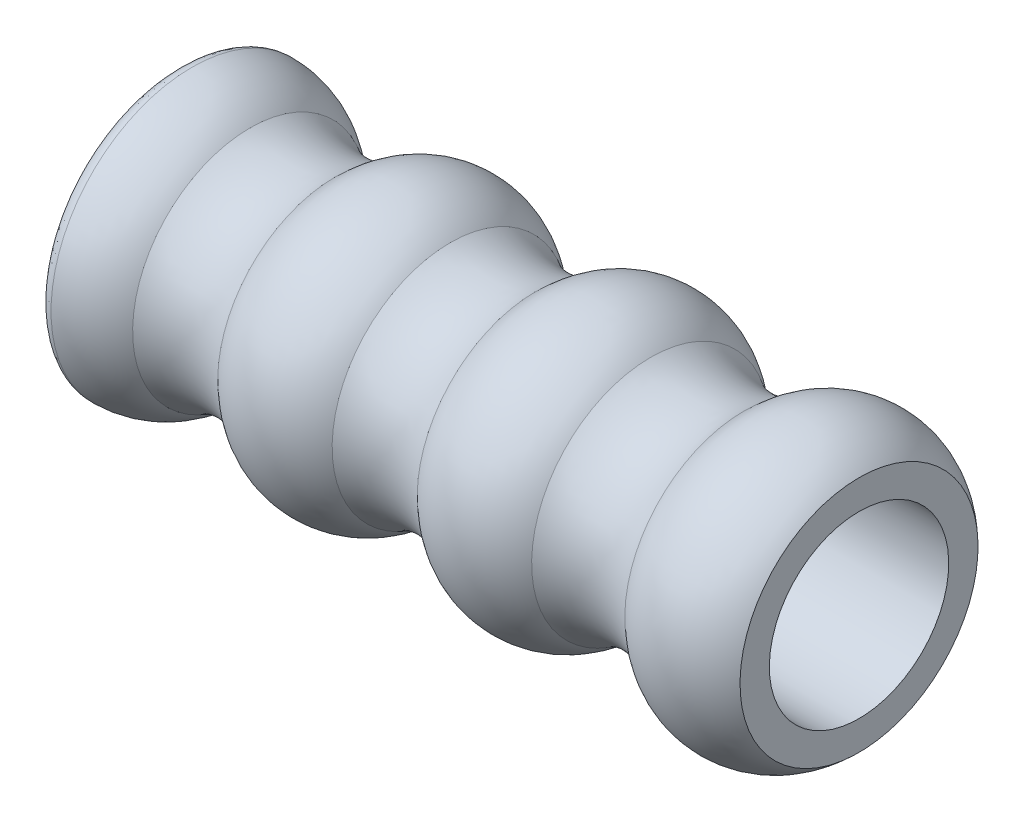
ISO-10303-21;
HEADER;
FILE_DESCRIPTION(('STEP AP214'),'2;1');
FILE_NAME('part.step','',(''),(''),'','','');
FILE_SCHEMA(('AUTOMOTIVE_DESIGN { 1 0 10303 214 1 1 1 1 }'));
ENDSEC;
DATA;
#1=APPLICATION_CONTEXT('core data for automotive mechanical design processes');
#2=APPLICATION_PROTOCOL_DEFINITION('international standard','automotive_design',2000,#1);
#3=PRODUCT_CONTEXT('',#1,'mechanical');
#4=PRODUCT('Part','Part','',(#3));
#5=PRODUCT_RELATED_PRODUCT_CATEGORY('part','',(#4));
#6=PRODUCT_DEFINITION_FORMATION('','',#4);
#7=PRODUCT_DEFINITION_CONTEXT('part definition',#1,'design');
#8=PRODUCT_DEFINITION('design','',#6,#7);
#9=PRODUCT_DEFINITION_SHAPE('','',#8);
#10=(LENGTH_UNIT() NAMED_UNIT(*) SI_UNIT(.MILLI.,.METRE.));
#11=(NAMED_UNIT(*) PLANE_ANGLE_UNIT() SI_UNIT($,.RADIAN.));
#12=(NAMED_UNIT(*) SI_UNIT($,.STERADIAN.) SOLID_ANGLE_UNIT());
#13=UNCERTAINTY_MEASURE_WITH_UNIT(LENGTH_MEASURE(1.E-05),#10,'distance_accuracy_value','');
#14=(GEOMETRIC_REPRESENTATION_CONTEXT(3) GLOBAL_UNCERTAINTY_ASSIGNED_CONTEXT((#13)) GLOBAL_UNIT_ASSIGNED_CONTEXT((#10,
#11,#12)) REPRESENTATION_CONTEXT('',''));
#15=CARTESIAN_POINT('',(0.,0.,0.));
#16=DIRECTION('',(0.,0.,1.));
#17=DIRECTION('',(1.,0.,0.));
#18=AXIS2_PLACEMENT_3D('',#15,#16,#17);
#19=CARTESIAN_POINT('',(1.88297787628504,-21.1381937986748,0.));
#20=DIRECTION('',(0.,0.,1.00000000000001));
#21=DIRECTION('',(0.,1.00000000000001,0.));
#22=AXIS2_PLACEMENT_3D('',#19,#20,#21);
#23=ELLIPSE('',#22,21.961784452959,6.03153225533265);
#24=TRIMMED_CURVE('',#23,(PARAMETER_VALUE(-1.57253642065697)),
(PARAMETER_VALUE(1.57253642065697)),.T.,.PARAMETER.);
#25=CARTESIAN_POINT('',(103.092609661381,-21.1764093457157,0.));
#26=DIRECTION('',(1.00000000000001,0.,0.));
#27=AXIS1_PLACEMENT('',#25,#26);
#28=SURFACE_OF_REVOLUTION('',#24,#27);
#29=CARTESIAN_POINT('',(-2.77282689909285,-21.1764093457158,0.));
#30=DIRECTION('',(1.00000000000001,0.,0.));
#31=DIRECTION('',(0.,1.00000000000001,0.));
#32=AXIS2_PLACEMENT_3D('',#29,#30,#31);
#33=CIRCLE('',#32,14.);
#34=CARTESIAN_POINT('',(-2.77282689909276,-7.17640934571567,0.));
#35=VERTEX_POINT('',#34);
#36=EDGE_CURVE('E383',#35,#35,#33,.F.);
#37=ORIENTED_EDGE('',*,*,#36,.F.);
#38=EDGE_LOOP('',(#37));
#39=FACE_BOUND('',#38,.T.);
#40=CARTESIAN_POINT('',(1.88297787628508,-21.1764093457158,0.));
#41=DIRECTION('',(1.00000000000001,0.,0.));
#42=DIRECTION('',(0.,1.00000000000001,0.));
#43=AXIS2_PLACEMENT_3D('',#40,#41,#42);
#44=CIRCLE('',#43,22.);
#45=CARTESIAN_POINT('',(1.88297787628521,0.8235906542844,0.));
#46=VERTEX_POINT('',#45);
#47=EDGE_CURVE('E358',#46,#46,#44,.T.);
#48=ORIENTED_EDGE('',*,*,#47,.F.);
#49=EDGE_LOOP('',(#48));
#50=FACE_BOUND('',#49,.T.);
#51=ADVANCED_FACE('F351',(#39,#50),#28,.F.);
#52=CARTESIAN_POINT('',(17.5818395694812,-21.1764093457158,0.));
#53=DIRECTION('',(1.00000000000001,0.,0.));
#54=DIRECTION('',(0.,1.00000000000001,0.));
#55=AXIS2_PLACEMENT_3D('',#52,#53,#54);
#56=TOROIDAL_SURFACE('',#55,29.5,13.);
#57=CARTESIAN_POINT('',(10.9427261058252,-21.1764093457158,0.));
#58=DIRECTION('',(1.00000000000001,0.,0.));
#59=DIRECTION('',(0.,1.00000000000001,0.));
#60=AXIS2_PLACEMENT_3D('',#57,#58,#59);
#61=CIRCLE('',#60,18.3231412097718);
#62=CARTESIAN_POINT('',(10.9427261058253,-2.85326813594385,0.));
#63=VERTEX_POINT('',#62);
#64=EDGE_CURVE('E10',#63,#63,#61,.T.);
#65=ORIENTED_EDGE('',*,*,#64,.T.);
#66=EDGE_LOOP('',(#65));
#67=FACE_BOUND('',#66,.T.);
#68=CARTESIAN_POINT('',(24.2209530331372,-21.1764093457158,0.));
#69=DIRECTION('',(1.00000000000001,0.,0.));
#70=DIRECTION('',(0.,1.00000000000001,0.));
#71=AXIS2_PLACEMENT_3D('',#68,#69,#70);
#72=CIRCLE('',#71,18.3231412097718);
#73=CARTESIAN_POINT('',(24.2209530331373,-2.85326813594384,0.));
#74=VERTEX_POINT('',#73);
#75=EDGE_CURVE('E380',#74,#74,#72,.T.);
#76=ORIENTED_EDGE('',*,*,#75,.F.);
#77=EDGE_LOOP('',(#76));
#78=FACE_BOUND('',#77,.T.);
#79=ADVANCED_FACE('F353',(#67,#78),#56,.F.);
#80=CARTESIAN_POINT('',(1.88297787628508,-21.1764093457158,0.));
#81=DIRECTION('',(1.00000000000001,0.,0.));
#82=DIRECTION('',(0.,1.00000000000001,0.));
#83=AXIS2_PLACEMENT_3D('',#80,#81,#82);
#84=DEGENERATE_TOROIDAL_SURFACE('',#83,8.99999999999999,13.,.T.);
#85=ORIENTED_EDGE('',*,*,#47,.T.);
#86=EDGE_LOOP('',(#85));
#87=FACE_BOUND('',#86,.T.);
#88=ORIENTED_EDGE('',*,*,#64,.F.);
#89=EDGE_LOOP('',(#88));
#90=FACE_BOUND('',#89,.T.);
#91=ADVANCED_FACE('F393',(#87,#90),#84,.T.);
#92=CARTESIAN_POINT('',(106.004684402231,-2.60089188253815,0.));
#93=DIRECTION('',(1.00000000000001,0.,0.));
#94=DIRECTION('',(0.,1.00000000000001,0.));
#95=AXIS2_PLACEMENT_3D('',#92,#93,#94);
#96=PLANE('',#95);
#97=CARTESIAN_POINT('',(106.004684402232,-21.1764093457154,0.));
#98=DIRECTION('',(1.00000000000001,0.,0.));
#99=DIRECTION('',(0.,1.00000000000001,0.));
#100=AXIS2_PLACEMENT_3D('',#97,#98,#99);
#101=CIRCLE('',#100,14.);
#102=CARTESIAN_POINT('',(106.004684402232,-7.17640934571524,0.));
#103=VERTEX_POINT('',#102);
#104=EDGE_CURVE('E448',#103,#103,#101,.T.);
#105=ORIENTED_EDGE('',*,*,#104,.F.);
#106=EDGE_LOOP('',(#105));
#107=FACE_BOUND('',#106,.T.);
#108=CARTESIAN_POINT('',(106.004684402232,-21.1764093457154,0.));
#109=DIRECTION('',(1.00000000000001,0.,0.));
#110=DIRECTION('',(0.,1.00000000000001,0.));
#111=AXIS2_PLACEMENT_3D('',#108,#109,#110);
#112=CIRCLE('',#111,18.5755174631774);
#113=CARTESIAN_POINT('',(106.004684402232,-2.60089188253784,0.));
#114=VERTEX_POINT('',#113);
#115=EDGE_CURVE('E362',#114,#114,#112,.T.);
#116=ORIENTED_EDGE('',*,*,#115,.T.);
#117=EDGE_LOOP('',(#116));
#118=FACE_BOUND('',#117,.T.);
#119=ADVANCED_FACE('F391',(#107,#118),#96,.T.);
#120=CARTESIAN_POINT('',(97.0107991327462,-21.1764093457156,0.));
#121=DIRECTION('',(1.00000000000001,0.,0.));
#122=DIRECTION('',(0.,1.00000000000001,0.));
#123=AXIS2_PLACEMENT_3D('',#120,#121,#122);
#124=DEGENERATE_TOROIDAL_SURFACE('',#123,9.1888232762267,13.,.T.);
#125=CARTESIAN_POINT('',(88.0169138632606,-21.1764093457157,0.));
#126=DIRECTION('',(1.00000000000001,0.,0.));
#127=DIRECTION('',(0.,1.00000000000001,0.));
#128=AXIS2_PLACEMENT_3D('',#125,#126,#127);
#129=CIRCLE('',#128,18.5755174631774);
#130=CARTESIAN_POINT('',(88.0169138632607,-2.60089188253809,0.));
#131=VERTEX_POINT('',#130);
#132=EDGE_CURVE('E366',#131,#131,#129,.T.);
#133=ORIENTED_EDGE('',*,*,#132,.T.);
#134=EDGE_LOOP('',(#133));
#135=FACE_BOUND('',#134,.T.);
#136=ORIENTED_EDGE('',*,*,#115,.F.);
#137=EDGE_LOOP('',(#136));
#138=FACE_BOUND('',#137,.T.);
#139=ADVANCED_FACE('F399',(#135,#138),#124,.T.);
#140=CARTESIAN_POINT('',(80.7458506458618,-21.1764093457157,0.));
#141=DIRECTION('',(1.00000000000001,0.,0.));
#142=DIRECTION('',(0.,1.00000000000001,0.));
#143=AXIS2_PLACEMENT_3D('',#140,#141,#142);
#144=TOROIDAL_SURFACE('',#143,29.3519565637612,13.);
#145=CARTESIAN_POINT('',(73.474787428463,-21.1764093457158,0.));
#146=DIRECTION('',(1.00000000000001,0.,0.));
#147=DIRECTION('',(0.,1.00000000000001,0.));
#148=AXIS2_PLACEMENT_3D('',#145,#146,#147);
#149=CIRCLE('',#148,18.5755174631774);
#150=CARTESIAN_POINT('',(73.4747874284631,-2.60089188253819,0.));
#151=VERTEX_POINT('',#150);
#152=EDGE_CURVE('E371',#151,#151,#149,.T.);
#153=ORIENTED_EDGE('',*,*,#152,.T.);
#154=EDGE_LOOP('',(#153));
#155=FACE_BOUND('',#154,.T.);
#156=ORIENTED_EDGE('',*,*,#132,.F.);
#157=EDGE_LOOP('',(#156));
#158=FACE_BOUND('',#157,.T.);
#159=ADVANCED_FACE('F423',(#155,#158),#144,.F.);
#160=CARTESIAN_POINT('',(64.5467319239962,-21.1764093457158,0.));
#161=DIRECTION('',(1.00000000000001,0.,0.));
#162=DIRECTION('',(0.,1.00000000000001,0.));
#163=AXIS2_PLACEMENT_3D('',#160,#161,#162);
#164=DEGENERATE_TOROIDAL_SURFACE('',#163,9.12618812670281,13.,.T.);
#165=CARTESIAN_POINT('',(55.4869836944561,-21.1764093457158,0.));
#166=DIRECTION('',(1.00000000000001,0.,0.));
#167=DIRECTION('',(0.,1.00000000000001,0.));
#168=AXIS2_PLACEMENT_3D('',#165,#166,#167);
#169=CIRCLE('',#168,18.4493293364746);
#170=CARTESIAN_POINT('',(55.4869836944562,-2.727080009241,0.));
#171=VERTEX_POINT('',#170);
#172=EDGE_CURVE('E374',#171,#171,#169,.T.);
#173=ORIENTED_EDGE('',*,*,#172,.T.);
#174=EDGE_LOOP('',(#173));
#175=FACE_BOUND('',#174,.T.);
#176=ORIENTED_EDGE('',*,*,#152,.F.);
#177=EDGE_LOOP('',(#176));
#178=FACE_BOUND('',#177,.T.);
#179=ADVANCED_FACE('F417',(#175,#178),#164,.T.);
#180=CARTESIAN_POINT('',(48.8478702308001,-21.1764093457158,0.));
#181=DIRECTION('',(1.00000000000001,0.,0.));
#182=DIRECTION('',(0.,1.00000000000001,0.));
#183=AXIS2_PLACEMENT_3D('',#180,#181,#182);
#184=TOROIDAL_SURFACE('',#183,29.6261881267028,13.);
#185=CARTESIAN_POINT('',(42.2087567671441,-21.1764093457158,0.));
#186=DIRECTION('',(1.00000000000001,0.,0.));
#187=DIRECTION('',(0.,1.00000000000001,0.));
#188=AXIS2_PLACEMENT_3D('',#185,#186,#187);
#189=CIRCLE('',#188,18.4493293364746);
#190=CARTESIAN_POINT('',(42.2087567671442,-2.72708000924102,0.));
#191=VERTEX_POINT('',#190);
#192=EDGE_CURVE('E377',#191,#191,#189,.T.);
#193=ORIENTED_EDGE('',*,*,#192,.T.);
#194=EDGE_LOOP('',(#193));
#195=FACE_BOUND('',#194,.T.);
#196=ORIENTED_EDGE('',*,*,#172,.F.);
#197=EDGE_LOOP('',(#196));
#198=FACE_BOUND('',#197,.T.);
#199=ADVANCED_FACE('F411',(#195,#198),#184,.F.);
#200=CARTESIAN_POINT('',(33.2807012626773,-21.1764093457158,0.));
#201=DIRECTION('',(1.00000000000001,0.,0.));
#202=DIRECTION('',(0.,1.00000000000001,0.));
#203=AXIS2_PLACEMENT_3D('',#200,#201,#202);
#204=DEGENERATE_TOROIDAL_SURFACE('',#203,8.99999999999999,13.,.T.);
#205=ORIENTED_EDGE('',*,*,#75,.T.);
#206=EDGE_LOOP('',(#205));
#207=FACE_BOUND('',#206,.T.);
#208=ORIENTED_EDGE('',*,*,#192,.F.);
#209=EDGE_LOOP('',(#208));
#210=FACE_BOUND('',#209,.T.);
#211=ADVANCED_FACE('F407',(#207,#210),#204,.T.);
#212=CARTESIAN_POINT('',(-4.14855437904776,-21.1764093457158,0.));
#213=DIRECTION('',(1.00000000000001,0.,0.));
#214=DIRECTION('',(0.,1.00000000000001,0.));
#215=AXIS2_PLACEMENT_3D('',#212,#213,#214);
#216=CYLINDRICAL_SURFACE('',#215,14.);
#217=ORIENTED_EDGE('',*,*,#36,.T.);
#218=EDGE_LOOP('',(#217));
#219=FACE_BOUND('',#218,.T.);
#220=ORIENTED_EDGE('',*,*,#104,.T.);
#221=EDGE_LOOP('',(#220));
#222=FACE_BOUND('',#221,.T.);
#223=ADVANCED_FACE('F410',(#219,#222),#216,.F.);
#224=CLOSED_SHELL('',(#51,#79,#91,#119,#139,#159,#179,#199,#211,#223));
#225=MANIFOLD_SOLID_BREP('B2',#224);
#226=ADVANCED_BREP_SHAPE_REPRESENTATION('',(#18,#225),#14);
#227=SHAPE_DEFINITION_REPRESENTATION(#9,#226);
ENDSEC;
END-ISO-10303-21;
